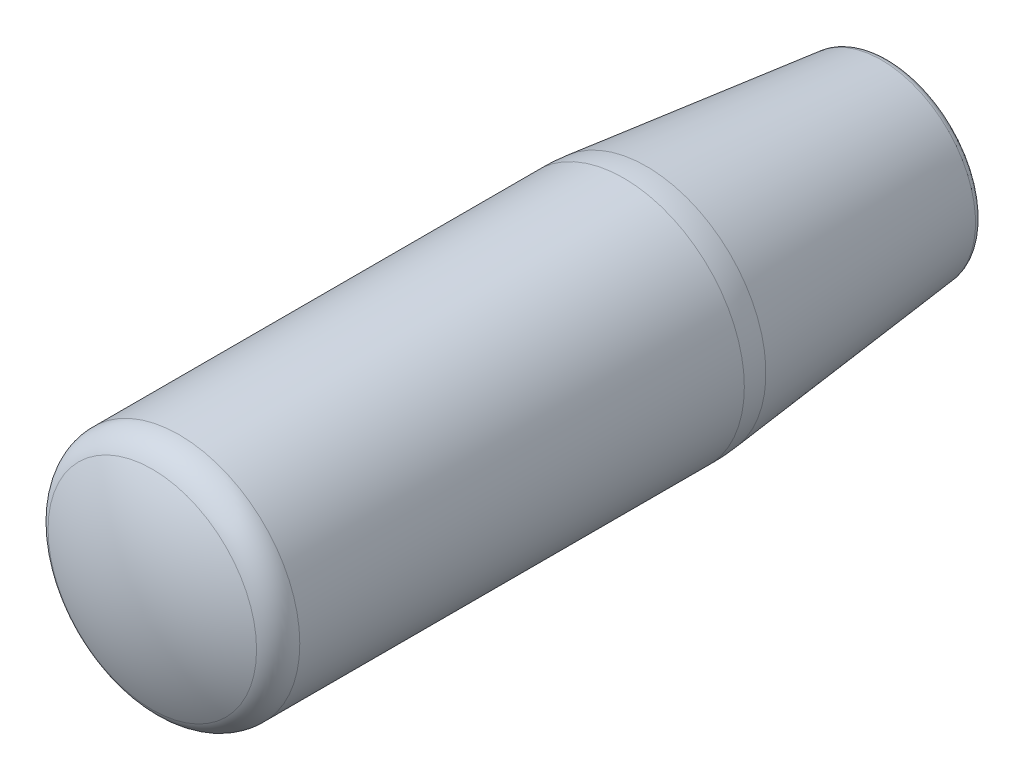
ISO-10303-21;
HEADER;
FILE_DESCRIPTION(('STEP AP214'),'2;1');
FILE_NAME('part.step','',(''),(''),'','','');
FILE_SCHEMA(('AUTOMOTIVE_DESIGN { 1 0 10303 214 1 1 1 1 }'));
ENDSEC;
DATA;
#1=APPLICATION_CONTEXT('core data for automotive mechanical design processes');
#2=APPLICATION_PROTOCOL_DEFINITION('international standard','automotive_design',2000,#1);
#3=PRODUCT_CONTEXT('',#1,'mechanical');
#4=PRODUCT('Part','Part','',(#3));
#5=PRODUCT_RELATED_PRODUCT_CATEGORY('part','',(#4));
#6=PRODUCT_DEFINITION_FORMATION('','',#4);
#7=PRODUCT_DEFINITION_CONTEXT('part definition',#1,'design');
#8=PRODUCT_DEFINITION('design','',#6,#7);
#9=PRODUCT_DEFINITION_SHAPE('','',#8);
#10=(LENGTH_UNIT() NAMED_UNIT(*) SI_UNIT(.MILLI.,.METRE.));
#11=(NAMED_UNIT(*) PLANE_ANGLE_UNIT() SI_UNIT($,.RADIAN.));
#12=(NAMED_UNIT(*) SI_UNIT($,.STERADIAN.) SOLID_ANGLE_UNIT());
#13=UNCERTAINTY_MEASURE_WITH_UNIT(LENGTH_MEASURE(1.E-05),#10,'distance_accuracy_value','');
#14=(GEOMETRIC_REPRESENTATION_CONTEXT(3) GLOBAL_UNCERTAINTY_ASSIGNED_CONTEXT((#13)) GLOBAL_UNIT_ASSIGNED_CONTEXT((#10,
#11,#12)) REPRESENTATION_CONTEXT('',''));
#15=CARTESIAN_POINT('',(0.,0.,0.));
#16=DIRECTION('',(0.,0.,1.));
#17=DIRECTION('',(1.,0.,0.));
#18=AXIS2_PLACEMENT_3D('',#15,#16,#17);
#19=CARTESIAN_POINT('',(0.,0.,63.0267857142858));
#20=DIRECTION('',(0.,0.,1.));
#21=DIRECTION('',(0.,1.,0.));
#22=AXIS2_PLACEMENT_3D('',#19,#20,#21);
#23=SPHERICAL_SURFACE('',#22,26.9732142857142);
#24=CARTESIAN_POINT('',(0.,0.,90.));
#25=VERTEX_POINT('',#24);
#26=VERTEX_LOOP('',#25);
#27=FACE_BOUND('',#26,.T.);
#28=CARTESIAN_POINT('',(0.,0.,87.0251850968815));
#29=DIRECTION('',(0.,0.,-1.));
#30=DIRECTION('',(-1.,0.,0.));
#31=AXIS2_PLACEMENT_3D('',#28,#29,#30);
#32=CIRCLE('',#31,12.3138586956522);
#33=CARTESIAN_POINT('',(-12.3138586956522,0.,87.0251850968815));
#34=VERTEX_POINT('',#33);
#35=EDGE_CURVE('E33',#34,#34,#32,.T.);
#36=ORIENTED_EDGE('',*,*,#35,.F.);
#37=EDGE_LOOP('',(#36));
#38=FACE_BOUND('',#37,.T.);
#39=ADVANCED_FACE('F15',(#27,#38),#23,.T.);
#40=CARTESIAN_POINT('',(0.,5.5,0.));
#41=DIRECTION('',(0.,0.,-1.));
#42=DIRECTION('',(-1.,0.,0.));
#43=AXIS2_PLACEMENT_3D('',#40,#41,#42);
#44=PLANE('',#43);
#45=CARTESIAN_POINT('',(0.,0.,0.));
#46=DIRECTION('',(0.,0.,-1.));
#47=DIRECTION('',(-1.,0.,0.));
#48=AXIS2_PLACEMENT_3D('',#45,#46,#47);
#49=CIRCLE('',#48,10.1024823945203);
#50=CARTESIAN_POINT('',(-10.1024823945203,0.,0.));
#51=VERTEX_POINT('',#50);
#52=EDGE_CURVE('E53',#51,#51,#49,.T.);
#53=ORIENTED_EDGE('',*,*,#52,.T.);
#54=EDGE_LOOP('',(#53));
#55=FACE_BOUND('',#54,.T.);
#56=CARTESIAN_POINT('',(0.,0.,0.));
#57=DIRECTION('',(0.,0.,-1.));
#58=DIRECTION('',(-1.,0.,0.));
#59=AXIS2_PLACEMENT_3D('',#56,#57,#58);
#60=CIRCLE('',#59,6.25);
#61=CARTESIAN_POINT('',(-6.25,0.,0.));
#62=VERTEX_POINT('',#61);
#63=EDGE_CURVE('E46',#62,#62,#60,.T.);
#64=ORIENTED_EDGE('',*,*,#63,.F.);
#65=EDGE_LOOP('',(#64));
#66=FACE_BOUND('',#65,.T.);
#67=ADVANCED_FACE('F28',(#55,#66),#44,.T.);
#68=CARTESIAN_POINT('',(0.,0.,83.8555851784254));
#69=DIRECTION('',(0.,0.,-1.));
#70=DIRECTION('',(-1.,0.,0.));
#71=AXIS2_PLACEMENT_3D('',#68,#69,#70);
#72=TOROIDAL_SURFACE('',#71,10.6875,3.5625);
#73=CARTESIAN_POINT('',(0.,0.,83.8555851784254));
#74=DIRECTION('',(0.,0.,1.));
#75=DIRECTION('',(1.,0.,0.));
#76=AXIS2_PLACEMENT_3D('',#73,#74,#75);
#77=CIRCLE('',#76,14.25);
#78=CARTESIAN_POINT('',(14.25,0.,83.8555851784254));
#79=VERTEX_POINT('',#78);
#80=EDGE_CURVE('E36',#79,#79,#77,.F.);
#81=ORIENTED_EDGE('',*,*,#80,.F.);
#82=EDGE_LOOP('',(#81));
#83=FACE_BOUND('',#82,.T.);
#84=ORIENTED_EDGE('',*,*,#35,.T.);
#85=EDGE_LOOP('',(#84));
#86=FACE_BOUND('',#85,.T.);
#87=ADVANCED_FACE('F85',(#83,#86),#72,.T.);
#88=CARTESIAN_POINT('',(0.,0.,30.));
#89=DIRECTION('',(0.,0.,1.));
#90=DIRECTION('',(1.,0.,0.));
#91=AXIS2_PLACEMENT_3D('',#88,#89,#90);
#92=CONICAL_SURFACE('',#91,14.25,0.107912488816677);
#93=CARTESIAN_POINT('',(0.,0.,28.6576374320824));
#94=DIRECTION('',(0.,0.,-1.));
#95=DIRECTION('',(-1.,0.,0.));
#96=AXIS2_PLACEMENT_3D('',#93,#94,#95);
#97=CIRCLE('',#96,14.1045773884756);
#98=CARTESIAN_POINT('',(-14.1045773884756,0.,28.6576374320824));
#99=VERTEX_POINT('',#98);
#100=EDGE_CURVE('E9',#99,#99,#97,.T.);
#101=ORIENTED_EDGE('',*,*,#100,.T.);
#102=EDGE_LOOP('',(#101));
#103=FACE_BOUND('',#102,.T.);
#104=CARTESIAN_POINT('',(0.,0.,0.8922968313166));
#105=DIRECTION('',(0.,0.,-1.));
#106=DIRECTION('',(-1.,0.,0.));
#107=AXIS2_PLACEMENT_3D('',#104,#105,#106);
#108=CIRCLE('',#107,11.0966654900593);
#109=CARTESIAN_POINT('',(-11.0966654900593,0.,0.8922968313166));
#110=VERTEX_POINT('',#109);
#111=EDGE_CURVE('E43',#110,#110,#108,.F.);
#112=ORIENTED_EDGE('',*,*,#111,.T.);
#113=EDGE_LOOP('',(#112));
#114=FACE_BOUND('',#113,.T.);
#115=ADVANCED_FACE('F75',(#103,#114),#92,.T.);
#116=CARTESIAN_POINT('',(0.,0.,56.9277925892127));
#117=DIRECTION('',(0.,0.,1.));
#118=DIRECTION('',(1.,0.,0.));
#119=AXIS2_PLACEMENT_3D('',#116,#117,#118);
#120=CYLINDRICAL_SURFACE('',#119,14.25);
#121=CARTESIAN_POINT('',(0.,0.,31.3502166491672));
#122=DIRECTION('',(0.,0.,-1.));
#123=DIRECTION('',(-1.,0.,0.));
#124=AXIS2_PLACEMENT_3D('',#121,#122,#123);
#125=CIRCLE('',#124,14.25);
#126=CARTESIAN_POINT('',(-14.25,0.,31.3502166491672));
#127=VERTEX_POINT('',#126);
#128=EDGE_CURVE('E23',#127,#127,#125,.F.);
#129=ORIENTED_EDGE('',*,*,#128,.T.);
#130=EDGE_LOOP('',(#129));
#131=FACE_BOUND('',#130,.T.);
#132=ORIENTED_EDGE('',*,*,#80,.T.);
#133=EDGE_LOOP('',(#132));
#134=FACE_BOUND('',#133,.T.);
#135=ADVANCED_FACE('F60',(#131,#134),#120,.T.);
#136=CARTESIAN_POINT('',(0.,0.,7.));
#137=DIRECTION('',(0.,0.,-1.));
#138=DIRECTION('',(-1.,0.,0.));
#139=AXIS2_PLACEMENT_3D('',#136,#137,#138);
#140=CYLINDRICAL_SURFACE('',#139,6.25);
#141=CARTESIAN_POINT('',(0.,0.,7.));
#142=DIRECTION('',(0.,0.,-1.));
#143=DIRECTION('',(-1.,0.,0.));
#144=AXIS2_PLACEMENT_3D('',#141,#142,#143);
#145=CIRCLE('',#144,6.25);
#146=CARTESIAN_POINT('',(-6.25,0.,7.));
#147=VERTEX_POINT('',#146);
#148=EDGE_CURVE('E37',#147,#147,#145,.T.);
#149=ORIENTED_EDGE('',*,*,#148,.F.);
#150=EDGE_LOOP('',(#149));
#151=FACE_BOUND('',#150,.T.);
#152=ORIENTED_EDGE('',*,*,#63,.T.);
#153=EDGE_LOOP('',(#152));
#154=FACE_BOUND('',#153,.T.);
#155=ADVANCED_FACE('F30',(#151,#154),#140,.F.);
#156=CARTESIAN_POINT('',(0.,5.125,7.));
#157=DIRECTION('',(0.,0.,1.));
#158=DIRECTION('',(1.,0.,0.));
#159=AXIS2_PLACEMENT_3D('',#156,#157,#158);
#160=PLANE('',#159);
#161=CARTESIAN_POINT('',(0.,0.,7.));
#162=DIRECTION('',(0.,0.,1.));
#163=DIRECTION('',(1.,0.,0.));
#164=AXIS2_PLACEMENT_3D('',#161,#162,#163);
#165=CIRCLE('',#164,5.);
#166=CARTESIAN_POINT('',(5.,0.,7.));
#167=VERTEX_POINT('',#166);
#168=EDGE_CURVE('E109',#167,#167,#165,.T.);
#169=ORIENTED_EDGE('',*,*,#168,.T.);
#170=EDGE_LOOP('',(#169));
#171=FACE_BOUND('',#170,.T.);
#172=ORIENTED_EDGE('',*,*,#148,.T.);
#173=EDGE_LOOP('',(#172));
#174=FACE_BOUND('',#173,.T.);
#175=ADVANCED_FACE('F82',(#171,#174),#160,.F.);
#176=CARTESIAN_POINT('',(0.,0.,56.));
#177=DIRECTION('',(0.,0.,-1.));
#178=DIRECTION('',(-1.,0.,0.));
#179=AXIS2_PLACEMENT_3D('',#176,#177,#178);
#180=CYLINDRICAL_SURFACE('',#179,5.);
#181=CARTESIAN_POINT('',(0.,0.,56.));
#182=DIRECTION('',(0.,0.,-1.));
#183=DIRECTION('',(-1.,0.,0.));
#184=AXIS2_PLACEMENT_3D('',#181,#182,#183);
#185=CIRCLE('',#184,5.);
#186=CARTESIAN_POINT('',(-5.,0.,56.));
#187=VERTEX_POINT('',#186);
#188=EDGE_CURVE('E117',#187,#187,#185,.T.);
#189=ORIENTED_EDGE('',*,*,#188,.F.);
#190=EDGE_LOOP('',(#189));
#191=FACE_BOUND('',#190,.T.);
#192=ORIENTED_EDGE('',*,*,#168,.F.);
#193=EDGE_LOOP('',(#192));
#194=FACE_BOUND('',#193,.T.);
#195=ADVANCED_FACE('F99',(#191,#194),#180,.F.);
#196=CARTESIAN_POINT('',(0.,0.,56.));
#197=DIRECTION('',(0.,0.,-1.));
#198=DIRECTION('',(-1.,0.,0.));
#199=AXIS2_PLACEMENT_3D('',#196,#197,#198);
#200=PLANE('',#199);
#201=ORIENTED_EDGE('',*,*,#188,.T.);
#202=EDGE_LOOP('',(#201));
#203=FACE_BOUND('',#202,.T.);
#204=ADVANCED_FACE('F71',(#203),#200,.T.);
#205=CARTESIAN_POINT('',(0.,0.,1.));
#206=DIRECTION('',(0.,0.,-1.));
#207=DIRECTION('',(-1.,0.,0.));
#208=AXIS2_PLACEMENT_3D('',#205,#206,#207);
#209=TOROIDAL_SURFACE('',#208,10.1024823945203,1.);
#210=ORIENTED_EDGE('',*,*,#52,.F.);
#211=EDGE_LOOP('',(#210));
#212=FACE_BOUND('',#211,.T.);
#213=ORIENTED_EDGE('',*,*,#111,.F.);
#214=EDGE_LOOP('',(#213));
#215=FACE_BOUND('',#214,.T.);
#216=ADVANCED_FACE('F64',(#212,#215),#209,.T.);
#217=CARTESIAN_POINT('',(0.,0.,31.3502166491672));
#218=DIRECTION('',(0.,0.,-1.));
#219=DIRECTION('',(-1.,0.,0.));
#220=AXIS2_PLACEMENT_3D('',#217,#218,#219);
#221=DEGENERATE_TOROIDAL_SURFACE('',#220,10.75,25.,.F.);
#222=ORIENTED_EDGE('',*,*,#100,.F.);
#223=EDGE_LOOP('',(#222));
#224=FACE_BOUND('',#223,.T.);
#225=ORIENTED_EDGE('',*,*,#128,.F.);
#226=EDGE_LOOP('',(#225));
#227=FACE_BOUND('',#226,.T.);
#228=ADVANCED_FACE('F17',(#224,#227),#221,.F.);
#229=CLOSED_SHELL('',(#39,#67,#87,#115,#135,#155,#175,#195,#204,#216,#228));
#230=MANIFOLD_SOLID_BREP('B1',#229);
#231=ADVANCED_BREP_SHAPE_REPRESENTATION('',(#18,#230),#14);
#232=SHAPE_DEFINITION_REPRESENTATION(#9,#231);
ENDSEC;
END-ISO-10303-21;
